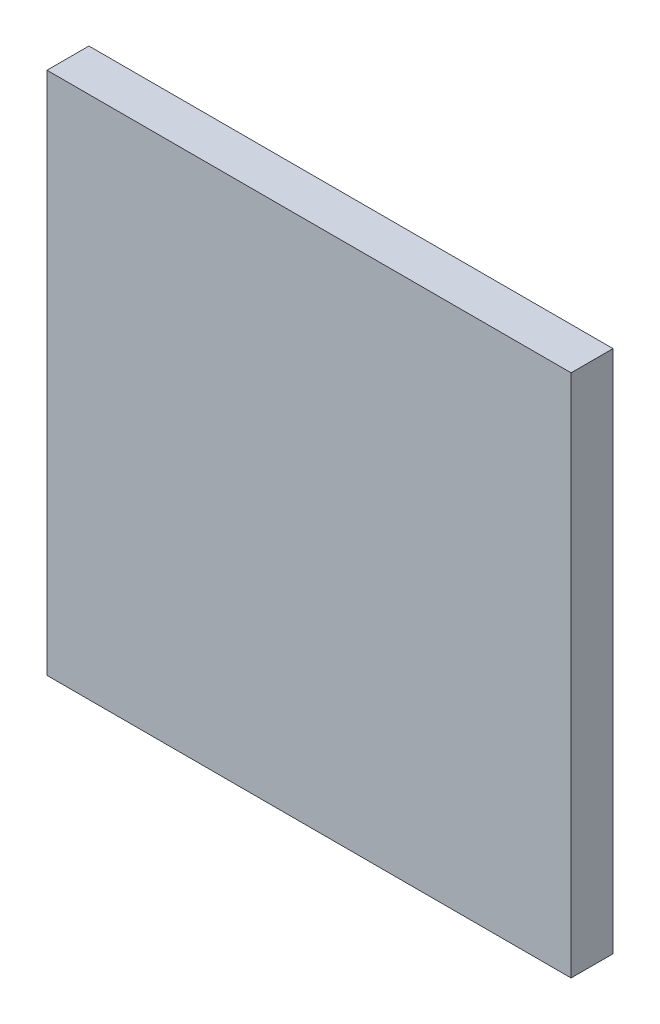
ISO-10303-21;
HEADER;
FILE_DESCRIPTION(('STEP AP214'),'2;1');
FILE_NAME('part.step','',(''),(''),'','','');
FILE_SCHEMA(('AUTOMOTIVE_DESIGN { 1 0 10303 214 1 1 1 1 }'));
ENDSEC;
DATA;
#1=APPLICATION_CONTEXT('core data for automotive mechanical design processes');
#2=APPLICATION_PROTOCOL_DEFINITION('international standard','automotive_design',2000,#1);
#3=PRODUCT_CONTEXT('',#1,'mechanical');
#4=PRODUCT('Part','Part','',(#3));
#5=PRODUCT_RELATED_PRODUCT_CATEGORY('part','',(#4));
#6=PRODUCT_DEFINITION_FORMATION('','',#4);
#7=PRODUCT_DEFINITION_CONTEXT('part definition',#1,'design');
#8=PRODUCT_DEFINITION('design','',#6,#7);
#9=PRODUCT_DEFINITION_SHAPE('','',#8);
#10=(LENGTH_UNIT() NAMED_UNIT(*) SI_UNIT(.MILLI.,.METRE.));
#11=(NAMED_UNIT(*) PLANE_ANGLE_UNIT() SI_UNIT($,.RADIAN.));
#12=(NAMED_UNIT(*) SI_UNIT($,.STERADIAN.) SOLID_ANGLE_UNIT());
#13=UNCERTAINTY_MEASURE_WITH_UNIT(LENGTH_MEASURE(1.E-05),#10,'distance_accuracy_value','');
#14=(GEOMETRIC_REPRESENTATION_CONTEXT(3) GLOBAL_UNCERTAINTY_ASSIGNED_CONTEXT((#13)) GLOBAL_UNIT_ASSIGNED_CONTEXT((#10,
#11,#12)) REPRESENTATION_CONTEXT('',''));
#15=CARTESIAN_POINT('',(0.,0.,0.));
#16=DIRECTION('',(0.,0.,1.));
#17=DIRECTION('',(1.,0.,0.));
#18=AXIS2_PLACEMENT_3D('',#15,#16,#17);
#19=CARTESIAN_POINT('',(0.,0.,12.));
#20=DIRECTION('',(0.,0.,1.));
#21=DIRECTION('',(1.,0.,0.));
#22=AXIS2_PLACEMENT_3D('',#19,#20,#21);
#23=PLANE('',#22);
#24=DIRECTION('',(1.,0.,0.));
#25=VECTOR('',#24,1.);
#26=CARTESIAN_POINT('',(-75.,-75.,12.));
#27=LINE('',#26,#25);
#28=CARTESIAN_POINT('',(-75.,-75.,12.));
#29=VERTEX_POINT('',#28);
#30=CARTESIAN_POINT('',(75.,-75.,12.));
#31=VERTEX_POINT('',#30);
#32=EDGE_CURVE('E80',#29,#31,#27,.T.);
#33=ORIENTED_EDGE('',*,*,#32,.T.);
#34=DIRECTION('',(0.,1.,0.));
#35=VECTOR('',#34,1.);
#36=CARTESIAN_POINT('',(75.,-75.,12.));
#37=LINE('',#36,#35);
#38=CARTESIAN_POINT('',(75.,75.,12.));
#39=VERTEX_POINT('',#38);
#40=EDGE_CURVE('E102',#31,#39,#37,.T.);
#41=ORIENTED_EDGE('',*,*,#40,.T.);
#42=DIRECTION('',(-1.,0.,0.));
#43=VECTOR('',#42,1.);
#44=CARTESIAN_POINT('',(75.,75.,12.));
#45=LINE('',#44,#43);
#46=CARTESIAN_POINT('',(-75.,75.,12.));
#47=VERTEX_POINT('',#46);
#48=EDGE_CURVE('E73',#39,#47,#45,.T.);
#49=ORIENTED_EDGE('',*,*,#48,.T.);
#50=DIRECTION('',(0.,-1.,0.));
#51=VECTOR('',#50,1.);
#52=CARTESIAN_POINT('',(-75.,75.,12.));
#53=LINE('',#52,#51);
#54=EDGE_CURVE('E10',#47,#29,#53,.T.);
#55=ORIENTED_EDGE('',*,*,#54,.T.);
#56=EDGE_LOOP('',(#33,#41,#49,#55));
#57=FACE_BOUND('',#56,.T.);
#58=ADVANCED_FACE('F16',(#57),#23,.T.);
#59=CARTESIAN_POINT('',(0.,0.,0.));
#60=DIRECTION('',(0.,0.,1.));
#61=DIRECTION('',(1.,0.,0.));
#62=AXIS2_PLACEMENT_3D('',#59,#60,#61);
#63=PLANE('',#62);
#64=DIRECTION('',(0.,-1.,0.));
#65=VECTOR('',#64,1.);
#66=CARTESIAN_POINT('',(-75.,75.,0.));
#67=LINE('',#66,#65);
#68=CARTESIAN_POINT('',(-75.,75.,0.));
#69=VERTEX_POINT('',#68);
#70=CARTESIAN_POINT('',(-75.,-75.,0.));
#71=VERTEX_POINT('',#70);
#72=EDGE_CURVE('E24',#69,#71,#67,.T.);
#73=ORIENTED_EDGE('',*,*,#72,.F.);
#74=DIRECTION('',(-1.,0.,0.));
#75=VECTOR('',#74,1.);
#76=CARTESIAN_POINT('',(75.,75.,0.));
#77=LINE('',#76,#75);
#78=CARTESIAN_POINT('',(75.,75.,0.));
#79=VERTEX_POINT('',#78);
#80=EDGE_CURVE('E103',#79,#69,#77,.T.);
#81=ORIENTED_EDGE('',*,*,#80,.F.);
#82=DIRECTION('',(0.,1.,0.));
#83=VECTOR('',#82,1.);
#84=CARTESIAN_POINT('',(75.,-75.,0.));
#85=LINE('',#84,#83);
#86=CARTESIAN_POINT('',(75.,-75.,0.));
#87=VERTEX_POINT('',#86);
#88=EDGE_CURVE('E82',#87,#79,#85,.T.);
#89=ORIENTED_EDGE('',*,*,#88,.F.);
#90=DIRECTION('',(1.,0.,0.));
#91=VECTOR('',#90,1.);
#92=CARTESIAN_POINT('',(-75.,-75.,0.));
#93=LINE('',#92,#91);
#94=EDGE_CURVE('E78',#71,#87,#93,.T.);
#95=ORIENTED_EDGE('',*,*,#94,.F.);
#96=EDGE_LOOP('',(#73,#81,#89,#95));
#97=FACE_BOUND('',#96,.T.);
#98=ADVANCED_FACE('F84',(#97),#63,.F.);
#99=CARTESIAN_POINT('',(-75.,75.,0.));
#100=DIRECTION('',(1.,0.,0.));
#101=DIRECTION('',(0.,1.,0.));
#102=AXIS2_PLACEMENT_3D('',#99,#100,#101);
#103=PLANE('',#102);
#104=ORIENTED_EDGE('',*,*,#72,.T.);
#105=DIRECTION('',(0.,0.,1.));
#106=VECTOR('',#105,1.);
#107=CARTESIAN_POINT('',(-75.,-75.,0.));
#108=LINE('',#107,#106);
#109=EDGE_CURVE('E67',#71,#29,#108,.T.);
#110=ORIENTED_EDGE('',*,*,#109,.T.);
#111=ORIENTED_EDGE('',*,*,#54,.F.);
#112=DIRECTION('',(0.,0.,1.));
#113=VECTOR('',#112,1.);
#114=CARTESIAN_POINT('',(-75.,75.,0.));
#115=LINE('',#114,#113);
#116=EDGE_CURVE('E70',#69,#47,#115,.T.);
#117=ORIENTED_EDGE('',*,*,#116,.F.);
#118=EDGE_LOOP('',(#104,#110,#111,#117));
#119=FACE_BOUND('',#118,.T.);
#120=ADVANCED_FACE('F66',(#119),#103,.F.);
#121=CARTESIAN_POINT('',(75.,75.,0.));
#122=DIRECTION('',(0.,-1.,0.));
#123=DIRECTION('',(0.,0.,-1.));
#124=AXIS2_PLACEMENT_3D('',#121,#122,#123);
#125=PLANE('',#124);
#126=ORIENTED_EDGE('',*,*,#80,.T.);
#127=ORIENTED_EDGE('',*,*,#116,.T.);
#128=ORIENTED_EDGE('',*,*,#48,.F.);
#129=DIRECTION('',(0.,0.,1.));
#130=VECTOR('',#129,1.);
#131=CARTESIAN_POINT('',(75.,75.,0.));
#132=LINE('',#131,#130);
#133=EDGE_CURVE('E98',#79,#39,#132,.T.);
#134=ORIENTED_EDGE('',*,*,#133,.F.);
#135=EDGE_LOOP('',(#126,#127,#128,#134));
#136=FACE_BOUND('',#135,.T.);
#137=ADVANCED_FACE('F114',(#136),#125,.F.);
#138=CARTESIAN_POINT('',(75.,-75.,0.));
#139=DIRECTION('',(-1.,0.,0.));
#140=DIRECTION('',(0.,0.,1.));
#141=AXIS2_PLACEMENT_3D('',#138,#139,#140);
#142=PLANE('',#141);
#143=ORIENTED_EDGE('',*,*,#88,.T.);
#144=ORIENTED_EDGE('',*,*,#133,.T.);
#145=ORIENTED_EDGE('',*,*,#40,.F.);
#146=DIRECTION('',(0.,0.,1.));
#147=VECTOR('',#146,1.);
#148=CARTESIAN_POINT('',(75.,-75.,0.));
#149=LINE('',#148,#147);
#150=EDGE_CURVE('E88',#87,#31,#149,.T.);
#151=ORIENTED_EDGE('',*,*,#150,.F.);
#152=EDGE_LOOP('',(#143,#144,#145,#151));
#153=FACE_BOUND('',#152,.T.);
#154=ADVANCED_FACE('F117',(#153),#142,.F.);
#155=CARTESIAN_POINT('',(-75.,-75.,0.));
#156=DIRECTION('',(0.,1.,0.));
#157=DIRECTION('',(1.,0.,0.));
#158=AXIS2_PLACEMENT_3D('',#155,#156,#157);
#159=PLANE('',#158);
#160=ORIENTED_EDGE('',*,*,#94,.T.);
#161=ORIENTED_EDGE('',*,*,#150,.T.);
#162=ORIENTED_EDGE('',*,*,#32,.F.);
#163=ORIENTED_EDGE('',*,*,#109,.F.);
#164=EDGE_LOOP('',(#160,#161,#162,#163));
#165=FACE_BOUND('',#164,.T.);
#166=ADVANCED_FACE('F76',(#165),#159,.F.);
#167=CLOSED_SHELL('',(#58,#98,#120,#137,#154,#166));
#168=MANIFOLD_SOLID_BREP('B1',#167);
#169=ADVANCED_BREP_SHAPE_REPRESENTATION('',(#18,#168),#14);
#170=SHAPE_DEFINITION_REPRESENTATION(#9,#169);
ENDSEC;
END-ISO-10303-21;
